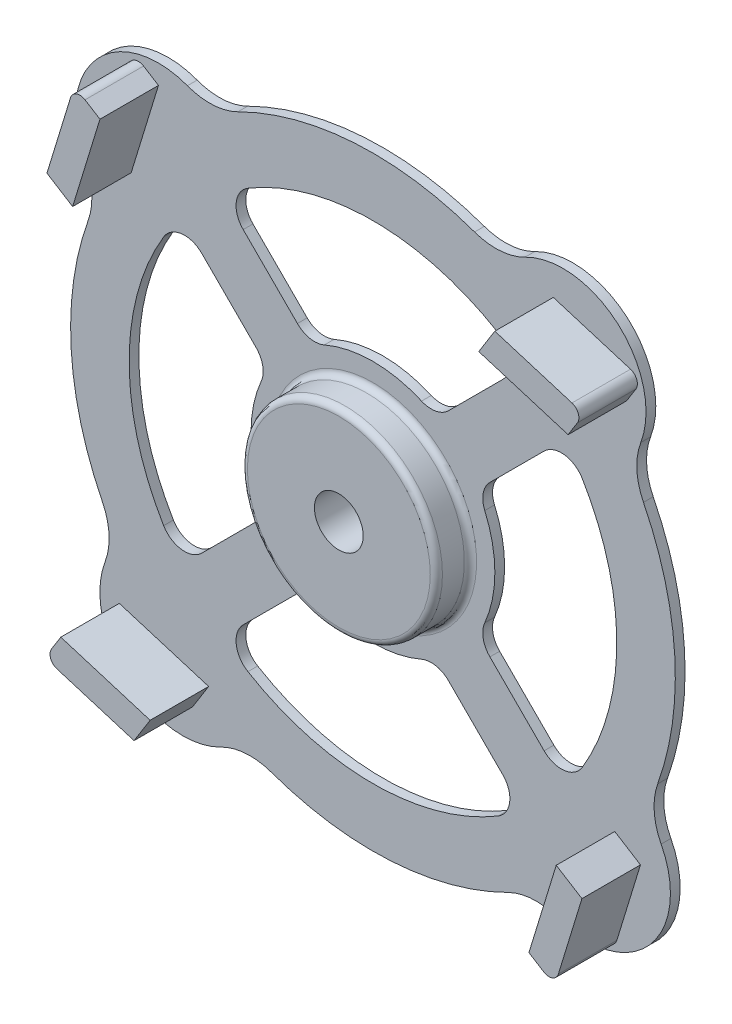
from build123d import *

# Parameters (mm, degrees)
SKETCH_1_R      = 5
EXTRUDE_1_DEPTH = 2
EXTRUDE_5_DEPTH = 12
SKETCH_6_R      = 20
SKETCH_6_R_2    = 5
EXTRUDE_6_DEPTH = 7
EXTRUDE_START   = 1
SKETCH_7_R      = 15
SKETCH_7_R_2    = 5
EXTRUDE_7_DEPTH = 1
FILLET_1_R      = 1.25


with BuildPart() as part:
    # Sketch 1 → Extrude 1 (new body)
    with BuildSketch(Plane.XY):
        with BuildLine():
            ThreePointArc((-38.050027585, 54.924755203), (-56.721897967, 50.276227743), (-59.095320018, 31.181348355))
            ThreePointArc((-59.095320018, 31.181348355), (-57.668494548, 26.080545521), (-58.39474136, 20.833967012))
            ThreePointArc((-58.39474136, 20.833967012), (-61.887807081, -3.728181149), (-55.47140759, -27.693373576))
            ThreePointArc((-55.47140759, -27.693373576), (-54.120580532, -32.814827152), (-54.924755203, -38.050027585))
            ThreePointArc((-54.924755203, -38.050027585), (-50.276227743, -56.721897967), (-31.181348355, -59.095320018))
            ThreePointArc((-31.181348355, -59.095320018), (-26.080545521, -57.668494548), (-20.833967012, -58.39474136))
            ThreePointArc((-20.833967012, -58.39474136), (3.728181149, -61.887807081), (27.693373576, -55.47140759))
            ThreePointArc((27.693373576, -55.47140759), (32.814827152, -54.120580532), (38.050027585, -54.924755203))
            ThreePointArc((38.050027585, -54.924755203), (56.721897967, -50.276227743), (59.095320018, -31.181348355))
            ThreePointArc((59.095320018, -31.181348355), (57.668494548, -26.080545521), (58.39474136, -20.833967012))
            ThreePointArc((58.39474136, -20.833967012), (61.887807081, 3.728181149), (55.47140759, 27.693373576))
            ThreePointArc((55.47140759, 27.693373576), (54.120580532, 32.814827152), (54.924755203, 38.050027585))
            ThreePointArc((54.924755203, 38.050027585), (50.276227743, 56.721897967), (31.181348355, 59.095320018))
            ThreePointArc((31.181348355, 59.095320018), (26.080545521, 57.668494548), (20.833967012, 58.39474136))
            ThreePointArc((20.833967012, 58.39474136), (-3.728181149, 61.887807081), (-27.693373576, 55.47140759))
            ThreePointArc((-27.693373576, 55.47140759), (-32.814827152, 54.120580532), (-38.050027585, 54.924755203))
        make_face()
        Circle(SKETCH_1_R, mode=Mode.SUBTRACT)
        with BuildLine():
            Line((15.493113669, 23.978395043), (26.611856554, 35.097137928))
            ThreePointArc((26.611856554, 35.097137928), (28.038256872, 39.248471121), (25.640358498, 42.925190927))
            ThreePointArc((25.640358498, 42.925190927), (0, 50), (-25.640358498, 42.925190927))
            ThreePointArc((-25.640358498, 42.925190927), (-28.038256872, 39.248471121), (-26.611856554, 35.097137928))
            Line((-26.611856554, 35.097137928), (-15.493113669, 23.978395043))
            ThreePointArc((-15.493113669, 23.978395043), (-12.890636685, 22.601759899), (-9.964649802, 22.928274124))
            ThreePointArc((-9.964649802, 22.928274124), (0, 25), (9.964649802, 22.928274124))
            ThreePointArc((9.964649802, 22.928274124), (12.890636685, 22.601759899), (15.493113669, 23.978395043))
        make_face(mode=Mode.SUBTRACT)
        with BuildLine():
            Line((23.978395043, -15.493113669), (35.097137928, -26.611856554))
            ThreePointArc((35.097137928, -26.611856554), (39.248471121, -28.038256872), (42.925190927, -25.640358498))
            ThreePointArc((42.925190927, -25.640358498), (50, 0), (42.925190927, 25.640358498))
            ThreePointArc((42.925190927, 25.640358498), (39.248471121, 28.038256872), (35.097137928, 26.611856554))
            Line((35.097137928, 26.611856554), (23.978395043, 15.493113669))
            ThreePointArc((23.978395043, 15.493113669), (22.601759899, 12.890636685), (22.928274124, 9.964649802))
            ThreePointArc((22.928274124, 9.964649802), (25, 0), (22.928274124, -9.964649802))
            ThreePointArc((22.928274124, -9.964649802), (22.601759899, -12.890636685), (23.978395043, -15.493113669))
        make_face(mode=Mode.SUBTRACT)
        with BuildLine():
            Line((-15.493113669, -23.978395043), (-26.611856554, -35.097137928))
            ThreePointArc((-26.611856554, -35.097137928), (-28.038256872, -39.248471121), (-25.640358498, -42.925190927))
            ThreePointArc((-25.640358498, -42.925190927), (0, -50), (25.640358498, -42.925190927))
            ThreePointArc((25.640358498, -42.925190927), (28.038256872, -39.248471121), (26.611856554, -35.097137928))
            Line((26.611856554, -35.097137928), (15.493113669, -23.978395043))
            ThreePointArc((15.493113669, -23.978395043), (12.890636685, -22.601759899), (9.964649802, -22.928274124))
            ThreePointArc((9.964649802, -22.928274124), (0, -25), (-9.964649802, -22.928274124))
            ThreePointArc((-9.964649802, -22.928274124), (-12.890636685, -22.601759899), (-15.493113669, -23.978395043))
        make_face(mode=Mode.SUBTRACT)
        with BuildLine():
            Line((-23.978395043, 15.493113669), (-35.097137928, 26.611856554))
            ThreePointArc((-35.097137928, 26.611856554), (-39.248471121, 28.038256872), (-42.925190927, 25.640358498))
            ThreePointArc((-42.925190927, 25.640358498), (-50, 0), (-42.925190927, -25.640358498))
            ThreePointArc((-42.925190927, -25.640358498), (-39.248471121, -28.038256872), (-35.097137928, -26.611856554))
            Line((-35.097137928, -26.611856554), (-23.978395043, -15.493113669))
            ThreePointArc((-23.978395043, -15.493113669), (-22.601759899, -12.890636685), (-22.928274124, -9.964649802))
            ThreePointArc((-22.928274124, -9.964649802), (-25, 0), (-22.928274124, 9.964649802))
            ThreePointArc((-22.928274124, 9.964649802), (-22.601759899, 12.890636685), (-23.978395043, 15.493113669))
        make_face(mode=Mode.SUBTRACT)
    extrude(amount=EXTRUDE_1_DEPTH)

    # Sketch 5 → Extrude 5 (add)
    with BuildSketch(Plane.XY.offset(2)):
        with BuildLine():
            Line((-54.852605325, 36.987822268), (-49.584821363, 33.696145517))
            Line((-49.584821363, 33.696145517), (-43.985140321, 52.011876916))
            Line((-43.985140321, 52.011876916), (-47.042528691, 53.922345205))
            ThreePointArc((-47.042528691, 53.922345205), (-48.802781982, 54.099593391), (-50.014976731, 52.810992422))
            Line((-50.014976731, 52.810992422), (-54.852605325, 36.987822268))
        make_face()
        with BuildLine():
            Line((36.987822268, 54.852605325), (33.696145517, 49.584821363))
            Line((33.696145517, 49.584821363), (52.011876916, 43.985140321))
            Line((52.011876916, 43.985140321), (53.922345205, 47.042528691))
            ThreePointArc((53.922345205, 47.042528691), (54.099593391, 48.802781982), (52.810992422, 50.014976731))
            Line((52.810992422, 50.014976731), (36.987822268, 54.852605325))
        make_face()
        with BuildLine():
            Line((54.852605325, -36.987822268), (49.584821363, -33.696145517))
            Line((49.584821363, -33.696145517), (43.985140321, -52.011876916))
            Line((43.985140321, -52.011876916), (47.042528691, -53.922345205))
            ThreePointArc((47.042528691, -53.922345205), (48.802781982, -54.099593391), (50.014976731, -52.810992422))
            Line((50.014976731, -52.810992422), (54.852605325, -36.987822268))
        make_face()
        with BuildLine():
            Line((-36.987822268, -54.852605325), (-33.696145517, -49.584821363))
            Line((-33.696145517, -49.584821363), (-52.011876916, -43.985140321))
            Line((-52.011876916, -43.985140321), (-53.922345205, -47.042528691))
            ThreePointArc((-53.922345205, -47.042528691), (-54.099593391, -48.802781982), (-52.810992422, -50.014976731))
            Line((-52.810992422, -50.014976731), (-36.987822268, -54.852605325))
        make_face()
    extrude(amount=EXTRUDE_5_DEPTH)

    # Sketch 6 → Extrude 6 (add)
    with BuildSketch(Plane.XY.offset(2)):
        with Locations(Location((0, 0, 0), (0, 0, 180))):
            Circle(SKETCH_6_R)
        Circle(SKETCH_6_R_2, mode=Mode.SUBTRACT)
    extrude(amount=EXTRUDE_6_DEPTH)

    # Sketch 7 → Extrude 7 (add)
    with BuildSketch(Plane(origin=(0, 0, 0), x_dir=(-1, 0, 0), z_dir=(0, 0, -1)).offset(EXTRUDE_START)):
        Circle(SKETCH_7_R)
        Circle(SKETCH_7_R_2, mode=Mode.SUBTRACT)
    extrude(amount=-EXTRUDE_7_DEPTH)

    # Fillet 1
    fillet_1_edges = [part.edges().sort_by_distance(p)[0] for p in [
        (20, 0, 2),
        (20, 0, 9),
    ]]
    fillet(fillet_1_edges, radius=FILLET_1_R)


solid = part.part
